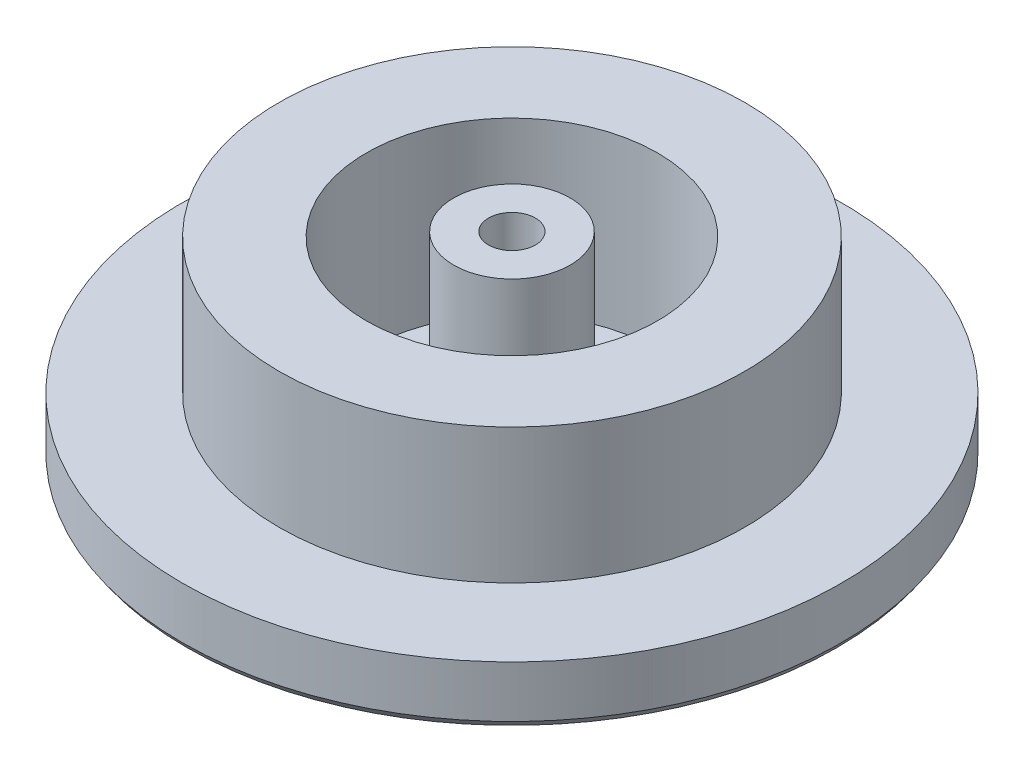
from build123d import *

# Parameters (mm, degrees)
CHAMFER1_SIZE               = 0.508
CHAMFER1_SIZE2              = 0.725499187
F_1_4_20_TAPPED_HOLE1_D     = 5.1054
F_1_4_20_TAPPED_HOLE1_DEPTH = 16.002
F_1_4_20_TAPPED_HOLE1_TIP   = 1.533816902


with BuildPart() as part:
    # Sketch1 → Revolve1 (revolve)
    with BuildSketch(Plane.XY, mode=Mode.PRIVATE) as revolve1_sk:
        Polygon((35.941, -15.24), (25.4, -15.24), (25.4, -0.508), (15.875, -0.508), (15.875, -19.05), (6.35, -19.05), (6.35, 0), (0, 0), (0, -21.59), (35.941, -21.59), align=None)
    revolve(revolve1_sk.sketch.rotate(Axis((0, 5.768851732, 0), (0, -1, 0)), 90), axis=Axis((0, 5.768851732, 0), (0, -1, 0)))

    # Chamfer1
    chamfer1_edges = [part.edges().sort_by_distance(p)[0] for p in [
        (0, -21.59, -35.941),
    ]]
    chamfer1_side = [part.faces().sort_by_distance(p)[0] for p in [
        (0, -21.59, 0),
    ]]
    chamfer(chamfer1_edges, length=CHAMFER1_SIZE, length2=CHAMFER1_SIZE2, reference=chamfer1_side[0])

    # 1_4-20 Tapped Hole1
    with Locations(Plane.ZX):
        with Locations((0, 0)):
            Hole(F_1_4_20_TAPPED_HOLE1_D / 2, depth=F_1_4_20_TAPPED_HOLE1_DEPTH)
            with Locations((0, 0, -(F_1_4_20_TAPPED_HOLE1_DEPTH + F_1_4_20_TAPPED_HOLE1_TIP / 2))):  # 118° drill point
                Cone(0, F_1_4_20_TAPPED_HOLE1_D / 2, F_1_4_20_TAPPED_HOLE1_TIP, mode=Mode.SUBTRACT)


solid = part.part
